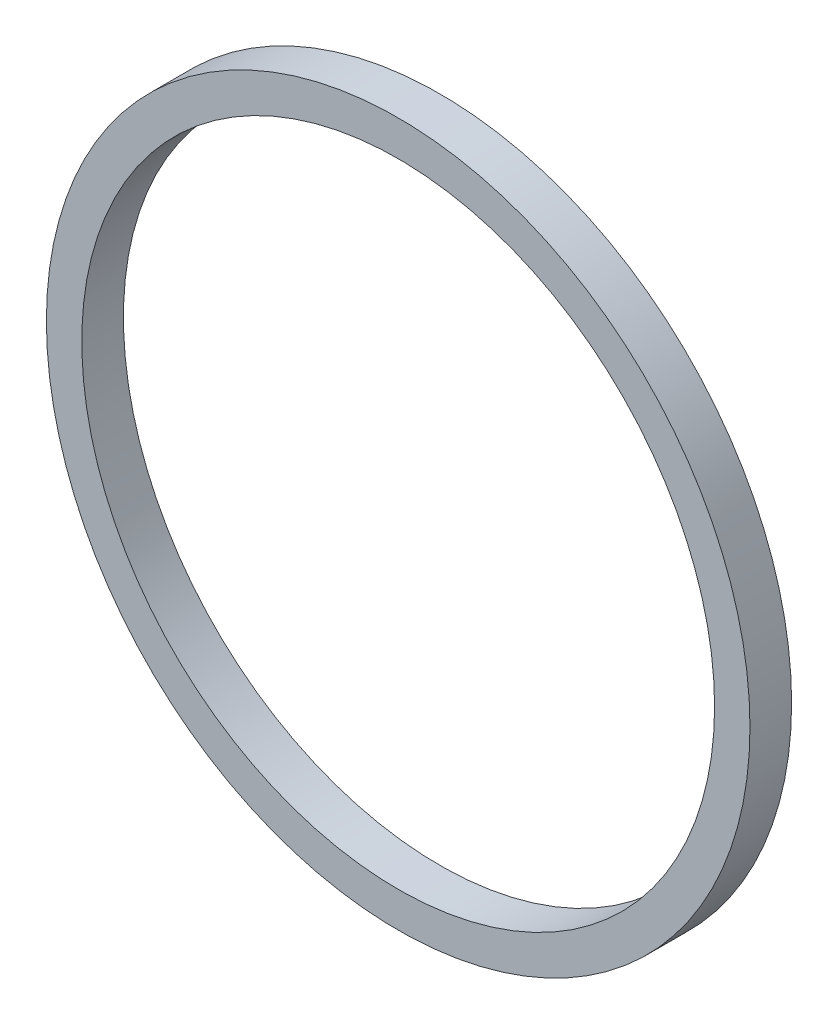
ISO-10303-21;
HEADER;
FILE_DESCRIPTION(('STEP AP214'),'2;1');
FILE_NAME('part.step','',(''),(''),'','','');
FILE_SCHEMA(('AUTOMOTIVE_DESIGN { 1 0 10303 214 1 1 1 1 }'));
ENDSEC;
DATA;
#1=APPLICATION_CONTEXT('core data for automotive mechanical design processes');
#2=APPLICATION_PROTOCOL_DEFINITION('international standard','automotive_design',2000,#1);
#3=PRODUCT_CONTEXT('',#1,'mechanical');
#4=PRODUCT('Part','Part','',(#3));
#5=PRODUCT_RELATED_PRODUCT_CATEGORY('part','',(#4));
#6=PRODUCT_DEFINITION_FORMATION('','',#4);
#7=PRODUCT_DEFINITION_CONTEXT('part definition',#1,'design');
#8=PRODUCT_DEFINITION('design','',#6,#7);
#9=PRODUCT_DEFINITION_SHAPE('','',#8);
#10=(LENGTH_UNIT() NAMED_UNIT(*) SI_UNIT(.MILLI.,.METRE.));
#11=(NAMED_UNIT(*) PLANE_ANGLE_UNIT() SI_UNIT($,.RADIAN.));
#12=(NAMED_UNIT(*) SI_UNIT($,.STERADIAN.) SOLID_ANGLE_UNIT());
#13=UNCERTAINTY_MEASURE_WITH_UNIT(LENGTH_MEASURE(1.E-05),#10,'distance_accuracy_value','');
#14=(GEOMETRIC_REPRESENTATION_CONTEXT(3) GLOBAL_UNCERTAINTY_ASSIGNED_CONTEXT((#13)) GLOBAL_UNIT_ASSIGNED_CONTEXT((#10,
#11,#12)) REPRESENTATION_CONTEXT('',''));
#15=CARTESIAN_POINT('',(0.,0.,0.));
#16=DIRECTION('',(0.,0.,1.));
#17=DIRECTION('',(1.,0.,0.));
#18=AXIS2_PLACEMENT_3D('',#15,#16,#17);
#19=CARTESIAN_POINT('',(0.,0.,1.27));
#20=DIRECTION('',(0.,0.,1.));
#21=DIRECTION('',(1.,0.,0.));
#22=AXIS2_PLACEMENT_3D('',#19,#20,#21);
#23=PLANE('',#22);
#24=CARTESIAN_POINT('',(0.,0.,1.27));
#25=DIRECTION('',(0.,0.,1.));
#26=DIRECTION('',(1.,0.,0.));
#27=AXIS2_PLACEMENT_3D('',#24,#25,#26);
#28=CIRCLE('',#27,10.7315);
#29=CARTESIAN_POINT('',(10.7315,0.,1.27));
#30=VERTEX_POINT('',#29);
#31=EDGE_CURVE('E10',#30,#30,#28,.T.);
#32=ORIENTED_EDGE('',*,*,#31,.T.);
#33=EDGE_LOOP('',(#32));
#34=FACE_BOUND('',#33,.T.);
#35=CARTESIAN_POINT('',(0.,0.,1.27));
#36=DIRECTION('',(0.,0.,1.));
#37=DIRECTION('',(1.,0.,0.));
#38=AXIS2_PLACEMENT_3D('',#35,#36,#37);
#39=CIRCLE('',#38,9.652);
#40=CARTESIAN_POINT('',(9.652,0.,1.27));
#41=VERTEX_POINT('',#40);
#42=EDGE_CURVE('E40',#41,#41,#39,.T.);
#43=ORIENTED_EDGE('',*,*,#42,.F.);
#44=EDGE_LOOP('',(#43));
#45=FACE_BOUND('',#44,.T.);
#46=ADVANCED_FACE('F29',(#34,#45),#23,.T.);
#47=CARTESIAN_POINT('',(0.,0.,0.));
#48=DIRECTION('',(0.,0.,1.));
#49=DIRECTION('',(1.,0.,0.));
#50=AXIS2_PLACEMENT_3D('',#47,#48,#49);
#51=PLANE('',#50);
#52=CARTESIAN_POINT('',(0.,0.,0.));
#53=DIRECTION('',(0.,0.,1.));
#54=DIRECTION('',(1.,0.,0.));
#55=AXIS2_PLACEMENT_3D('',#52,#53,#54);
#56=CIRCLE('',#55,10.7315);
#57=CARTESIAN_POINT('',(10.7315,0.,0.));
#58=VERTEX_POINT('',#57);
#59=EDGE_CURVE('E33',#58,#58,#56,.T.);
#60=ORIENTED_EDGE('',*,*,#59,.F.);
#61=EDGE_LOOP('',(#60));
#62=FACE_BOUND('',#61,.T.);
#63=CARTESIAN_POINT('',(0.,0.,0.));
#64=DIRECTION('',(0.,0.,1.));
#65=DIRECTION('',(1.,0.,0.));
#66=AXIS2_PLACEMENT_3D('',#63,#64,#65);
#67=CIRCLE('',#66,9.652);
#68=CARTESIAN_POINT('',(9.652,0.,0.));
#69=VERTEX_POINT('',#68);
#70=EDGE_CURVE('E42',#69,#69,#67,.T.);
#71=ORIENTED_EDGE('',*,*,#70,.T.);
#72=EDGE_LOOP('',(#71));
#73=FACE_BOUND('',#72,.T.);
#74=ADVANCED_FACE('F52',(#62,#73),#51,.F.);
#75=CARTESIAN_POINT('',(0.,0.,1.27));
#76=DIRECTION('',(0.,0.,-1.));
#77=DIRECTION('',(-1.,0.,0.));
#78=AXIS2_PLACEMENT_3D('',#75,#76,#77);
#79=CYLINDRICAL_SURFACE('',#78,10.7315);
#80=ORIENTED_EDGE('',*,*,#31,.F.);
#81=EDGE_LOOP('',(#80));
#82=FACE_BOUND('',#81,.T.);
#83=ORIENTED_EDGE('',*,*,#59,.T.);
#84=EDGE_LOOP('',(#83));
#85=FACE_BOUND('',#84,.T.);
#86=ADVANCED_FACE('F31',(#82,#85),#79,.T.);
#87=CARTESIAN_POINT('',(0.,0.,1.27));
#88=DIRECTION('',(0.,0.,-1.));
#89=DIRECTION('',(-1.,0.,0.));
#90=AXIS2_PLACEMENT_3D('',#87,#88,#89);
#91=CYLINDRICAL_SURFACE('',#90,9.652);
#92=ORIENTED_EDGE('',*,*,#42,.T.);
#93=EDGE_LOOP('',(#92));
#94=FACE_BOUND('',#93,.T.);
#95=ORIENTED_EDGE('',*,*,#70,.F.);
#96=EDGE_LOOP('',(#95));
#97=FACE_BOUND('',#96,.T.);
#98=ADVANCED_FACE('F48',(#94,#97),#91,.F.);
#99=CLOSED_SHELL('',(#46,#74,#86,#98));
#100=MANIFOLD_SOLID_BREP('B2',#99);
#101=ADVANCED_BREP_SHAPE_REPRESENTATION('',(#18,#100),#14);
#102=SHAPE_DEFINITION_REPRESENTATION(#9,#101);
ENDSEC;
END-ISO-10303-21;
